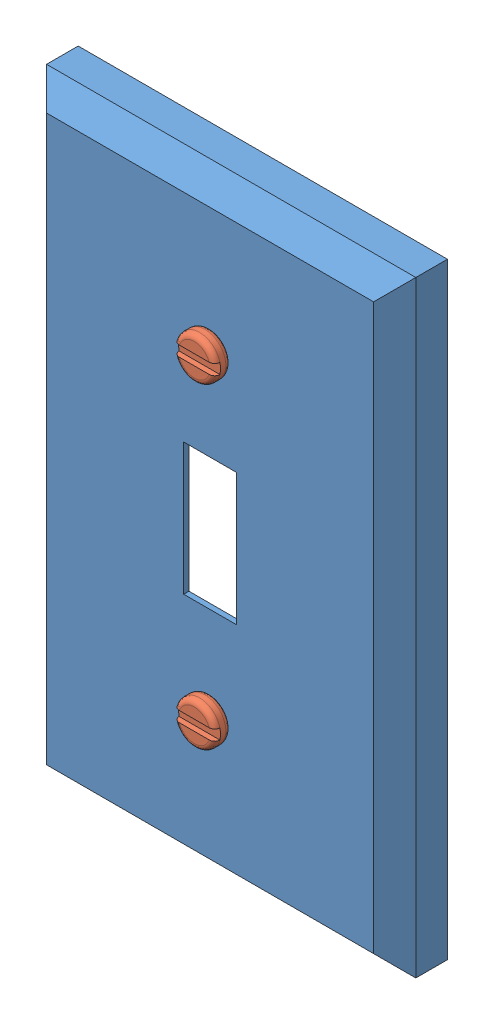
SolidWorks assembly switchplate-fastener.SLDASM, configuration Default (file format 8000). Lengths in mm.
Overall size (70 115 18.07).
3 component instances, 2 part files, 6 mates.
Components (placement in the parent):
- switchplate-1: switchplate.SLDPRT [Default] at origin size (70 115 10)
- fastener-1: fastener.SLDPRT [Default] at (35 87.5 10) x (0 1 0) z (0 0 1) size (8 8 18.07)
- fastener-2: fastener.SLDPRT [Default] at (35 27.5 10) x (0 1 0) z (0 0 1) size (8 8 18.07)
Mates (geometry in assembly coordinates):
- Concentric1: concentric aligned: cylinder of switchplate-1 through (35 87.5 0) axis (0 0 1) radius 2; cylinder of fastener-1 through (35 87.5 -5) axis (0 0 1) radius 1.75
- Coincident1: coincident anti-aligned: plane of switchplate-1 through (0 115 10) normal (0 0 1); plane of fastener-1 through (35 87.5 10) normal (0 0 -1)
- Parallel2: parallel aligned: plane of switchplate-1 through (0 115 10) normal (0 1 0); plane of fastener-1 through (30.0006 86.5 12) normal (0 1 0)
- Coincident2: coincident anti-aligned: plane of switchplate-1 through (0 115 10) normal (0 0 1); plane of fastener-2 through (35 27.5 10) normal (0 0 -1)
- Concentric3: concentric aligned: cylinder of switchplate-1 through (35 27.5 0) axis (0 0 1) radius 2; cylinder of fastener-2 through (35 27.5 -5) axis (0 0 1) radius 1.75
- Parallel3: parallel aligned: plane of switchplate-1 through (0 115 10) normal (0 1 0); plane of fastener-2 through (30.0006 26.5 12) normal (0 1 0)
